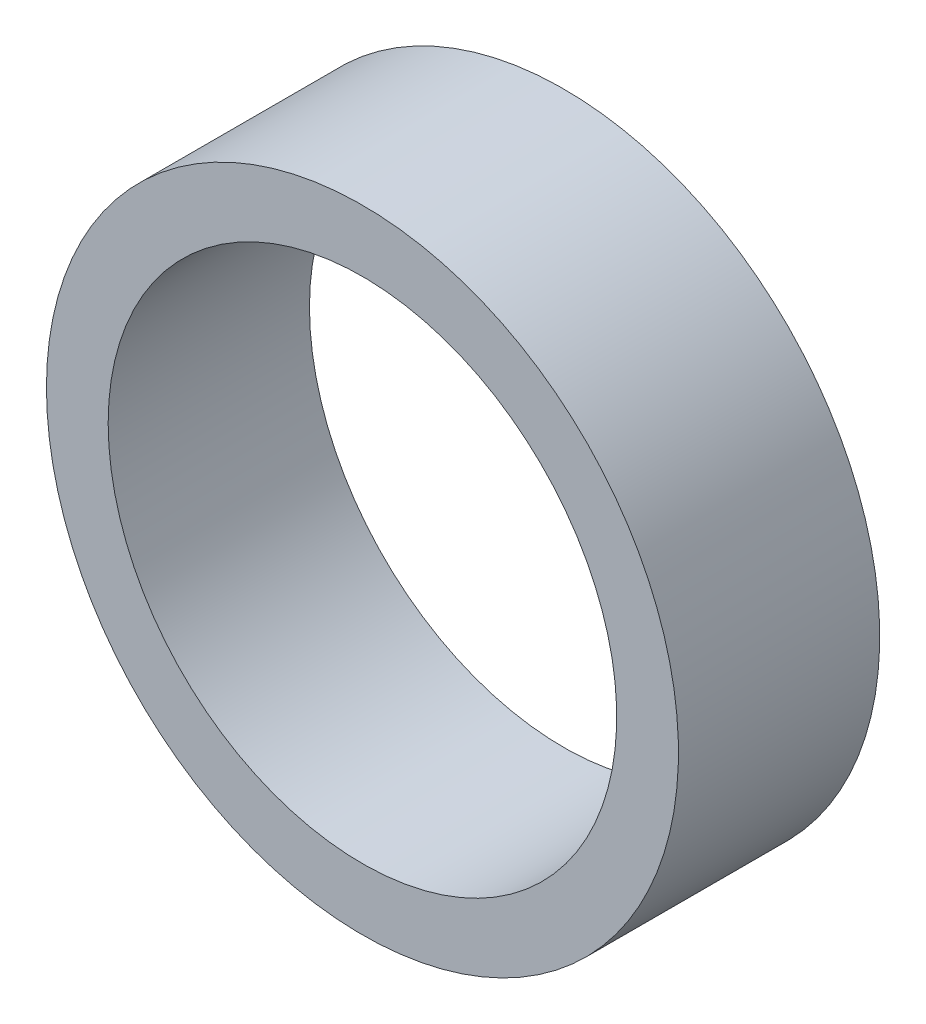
from build123d import *

# Parameters (mm, degrees)
SKETCH1_R      = 5.9817
SKETCH1_R_2    = 4.8133
EXTRUDE1_DEPTH = 1.905


with BuildPart() as part:
    # Sketch1 → Extrude1 (new, symmetric)
    with BuildSketch(Plane.XY):
        with Locations(Location((0, 0, 0), (0, 0, 180))):
            Circle(SKETCH1_R)
        with Locations(Location((0, 0, 0), (0, 0, 180))):
            Circle(SKETCH1_R_2, mode=Mode.SUBTRACT)
    extrude(amount=EXTRUDE1_DEPTH, both=True)


solid = part.part
